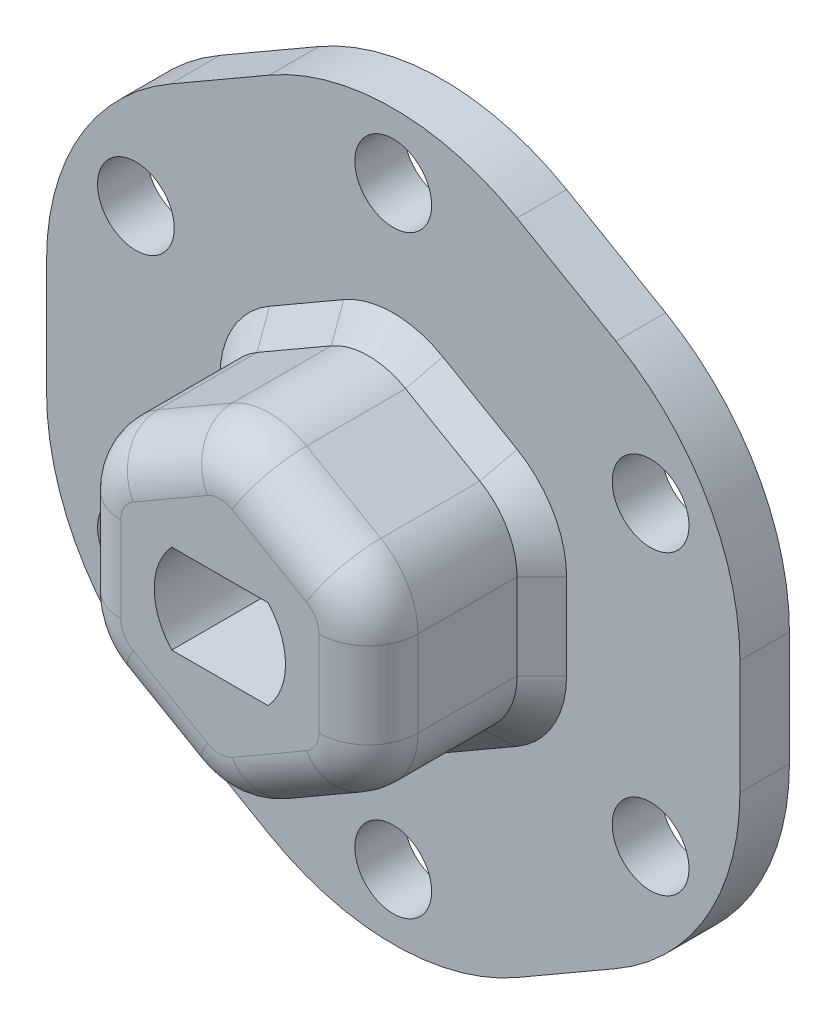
from build123d import *

# Parameters (mm, degrees)
SKETCH1_R           = 1.55
BOSS_EXTRUDE1_DEPTH = 2
BOSS_EXTRUDE4_DEPTH = 7
CHAMFER2_SIZE       = 1
FILLET1_R           = 2


with BuildPart() as part:
    # Sketch1 → Boss-Extrude1 (new body)
    with BuildSketch(Plane.XY):
        with BuildLine():
            Line((-5, 13.279056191), (-9, 10.969655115))
            ThreePointArc((-9, 10.969655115), (-12.660254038, 7.309401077), (-14, 2.309401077))
            Line((-14, 2.309401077), (-14, -2.309401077))
            ThreePointArc((-14, -2.309401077), (-12.660254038, -7.309401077), (-9, -10.969655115))
            Line((-9, -10.969655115), (-5, -13.279056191))
            ThreePointArc((-5, -13.279056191), (0, -14.618802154), (5, -13.279056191))
            Line((5, -13.279056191), (9, -10.969655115))
            ThreePointArc((9, -10.969655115), (12.660254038, -7.309401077), (14, -2.309401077))
            Line((14, -2.309401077), (14, 2.309401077))
            ThreePointArc((14, 2.309401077), (12.660254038, 7.309401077), (9, 10.969655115))
            Line((9, 10.969655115), (5, 13.279056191))
            ThreePointArc((5, 13.279056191), (0, 14.618802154), (-5, 13.279056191))
        make_face()
        with Locations((0, 12)):
            Circle(SKETCH1_R, mode=Mode.SUBTRACT)
        with Locations((10.392304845, 6)):
            Circle(SKETCH1_R, mode=Mode.SUBTRACT)
        with Locations((10.392304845, -6)):
            Circle(SKETCH1_R, mode=Mode.SUBTRACT)
        with Locations((0, -12)):
            Circle(SKETCH1_R, mode=Mode.SUBTRACT)
        with Locations((-10.392304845, -6)):
            Circle(SKETCH1_R, mode=Mode.SUBTRACT)
        with Locations((-10.392304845, 6)):
            Circle(SKETCH1_R, mode=Mode.SUBTRACT)
    extrude(amount=BOSS_EXTRUDE1_DEPTH)

    # Sketch3 → Boss-Extrude4 (add)
    with BuildSketch(Plane.XY.offset(2)):
        with BuildLine():
            Line((-1.5, 6.062177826), (-4.5, 4.330127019))
            ThreePointArc((-4.5, 4.330127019), (-5.598076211, 3.232050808), (-6, 1.732050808))
            Line((-6, 1.732050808), (-6, -1.732050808))
            ThreePointArc((-6, -1.732050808), (-5.598076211, -3.232050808), (-4.5, -4.330127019))
            Line((-4.5, -4.330127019), (-1.5, -6.062177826))
            ThreePointArc((-1.5, -6.062177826), (0, -6.464101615), (1.5, -6.062177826))
            Line((1.5, -6.062177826), (4.5, -4.330127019))
            ThreePointArc((4.5, -4.330127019), (5.598076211, -3.232050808), (6, -1.732050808))
            Line((6, -1.732050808), (6, 1.732050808))
            ThreePointArc((6, 1.732050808), (5.598076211, 3.232050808), (4.5, 4.330127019))
            Line((4.5, 4.330127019), (1.5, 6.062177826))
            ThreePointArc((1.5, 6.062177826), (0, 6.464101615), (-1.5, 6.062177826))
        make_face()
        with BuildLine():
            Line((1.944865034, -1.8), (-1.944865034, -1.8))
            ThreePointArc((-1.944865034, -1.8), (-2.65, 0), (-1.944865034, 1.8))
            Line((-1.944865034, 1.8), (1.944865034, 1.8))
            ThreePointArc((1.944865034, 1.8), (2.65, 0), (1.944865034, -1.8))
        make_face(mode=Mode.SUBTRACT)
    extrude(amount=BOSS_EXTRUDE4_DEPTH)

    # Chamfer2
    chamfer2_edges = [part.edges().sort_by_distance(p)[0] for p in [
        (5.598076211, 3.232050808, 2),
        (3, 5.196152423, 2),
        (0, 6.464101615, 2),
        (-3, 5.196152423, 2),
        (-5.598076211, 3.232050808, 2),
        (-6, 0, 2),
        (-5.598076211, -3.232050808, 2),
        (-3, -5.196152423, 2),
        (0, -6.464101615, 2),
        (3, -5.196152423, 2),
        (5.598076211, -3.232050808, 2),
        (6, 0, 2),
    ]]
    chamfer(chamfer2_edges, length=CHAMFER2_SIZE)

    # Fillet1
    fillet1_edges = [part.edges().sort_by_distance(p)[0] for p in [
        (5.598076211, 3.232050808, 9),
        (3, 5.196152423, 9),
        (0, 6.464101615, 9),
        (-3, 5.196152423, 9),
        (-5.598076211, 3.232050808, 9),
        (-6, 0, 9),
        (-5.598076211, -3.232050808, 9),
        (-3, -5.196152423, 9),
        (0, -6.464101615, 9),
        (3, -5.196152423, 9),
        (5.598076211, -3.232050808, 9),
        (6, 0, 9),
    ]]
    fillet(fillet1_edges, radius=FILLET1_R)


solid = part.part
